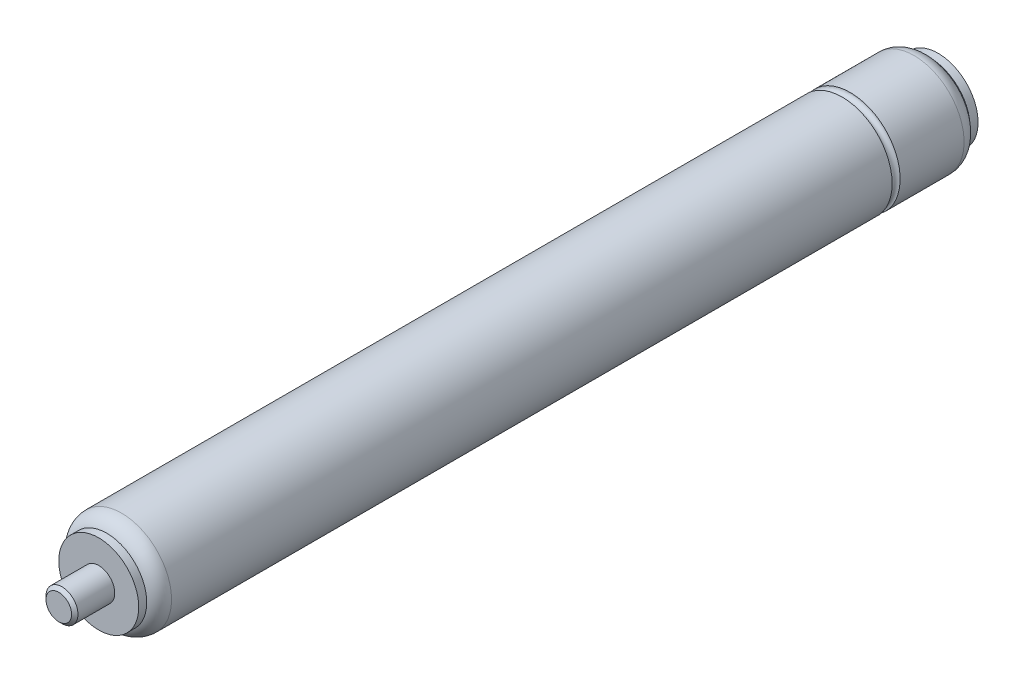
ISO-10303-21;
HEADER;
FILE_DESCRIPTION(('STEP AP214'),'2;1');
FILE_NAME('part.step','',(''),(''),'','','');
FILE_SCHEMA(('AUTOMOTIVE_DESIGN { 1 0 10303 214 1 1 1 1 }'));
ENDSEC;
DATA;
#1=APPLICATION_CONTEXT('core data for automotive mechanical design processes');
#2=APPLICATION_PROTOCOL_DEFINITION('international standard','automotive_design',2000,#1);
#3=PRODUCT_CONTEXT('',#1,'mechanical');
#4=PRODUCT('Part','Part','',(#3));
#5=PRODUCT_RELATED_PRODUCT_CATEGORY('part','',(#4));
#6=PRODUCT_DEFINITION_FORMATION('','',#4);
#7=PRODUCT_DEFINITION_CONTEXT('part definition',#1,'design');
#8=PRODUCT_DEFINITION('design','',#6,#7);
#9=PRODUCT_DEFINITION_SHAPE('','',#8);
#10=(LENGTH_UNIT() NAMED_UNIT(*) SI_UNIT(.MILLI.,.METRE.));
#11=(NAMED_UNIT(*) PLANE_ANGLE_UNIT() SI_UNIT($,.RADIAN.));
#12=(NAMED_UNIT(*) SI_UNIT($,.STERADIAN.) SOLID_ANGLE_UNIT());
#13=UNCERTAINTY_MEASURE_WITH_UNIT(LENGTH_MEASURE(1.E-05),#10,'distance_accuracy_value','');
#14=(GEOMETRIC_REPRESENTATION_CONTEXT(3) GLOBAL_UNCERTAINTY_ASSIGNED_CONTEXT((#13)) GLOBAL_UNIT_ASSIGNED_CONTEXT((#10,
#11,#12)) REPRESENTATION_CONTEXT('',''));
#15=CARTESIAN_POINT('',(0.,0.,0.));
#16=DIRECTION('',(0.,0.,1.));
#17=DIRECTION('',(1.,0.,0.));
#18=AXIS2_PLACEMENT_3D('',#15,#16,#17);
#19=CARTESIAN_POINT('',(0.,0.,-208.));
#20=DIRECTION('',(0.,0.,1.));
#21=DIRECTION('',(1.,0.,0.));
#22=AXIS2_PLACEMENT_3D('',#19,#20,#21);
#23=CYLINDRICAL_SURFACE('',#22,12.5);
#24=CARTESIAN_POINT('',(0.,0.,-188.));
#25=DIRECTION('',(0.,0.,-1.));
#26=DIRECTION('',(-1.,0.,0.));
#27=AXIS2_PLACEMENT_3D('',#24,#25,#26);
#28=CIRCLE('',#27,12.5);
#29=CARTESIAN_POINT('',(-12.5,0.,-188.));
#30=VERTEX_POINT('',#29);
#31=EDGE_CURVE('E82',#30,#30,#28,.T.);
#32=ORIENTED_EDGE('',*,*,#31,.T.);
#33=EDGE_LOOP('',(#32));
#34=FACE_BOUND('',#33,.T.);
#35=CARTESIAN_POINT('',(0.,0.,-204.));
#36=DIRECTION('',(0.,0.,-1.));
#37=DIRECTION('',(-1.,0.,0.));
#38=AXIS2_PLACEMENT_3D('',#35,#36,#37);
#39=CIRCLE('',#38,12.5);
#40=CARTESIAN_POINT('',(-12.5,0.,-204.));
#41=VERTEX_POINT('',#40);
#42=EDGE_CURVE('E10',#41,#41,#39,.F.);
#43=ORIENTED_EDGE('',*,*,#42,.T.);
#44=EDGE_LOOP('',(#43));
#45=FACE_BOUND('',#44,.T.);
#46=ADVANCED_FACE('F35',(#34,#45),#23,.T.);
#47=CARTESIAN_POINT('',(0.,0.,-204.));
#48=DIRECTION('',(0.,0.,-1.));
#49=DIRECTION('',(-1.,0.,0.));
#50=AXIS2_PLACEMENT_3D('',#47,#48,#49);
#51=TOROIDAL_SURFACE('',#50,8.5,4.);
#52=ORIENTED_EDGE('',*,*,#42,.F.);
#53=EDGE_LOOP('',(#52));
#54=FACE_BOUND('',#53,.T.);
#55=CARTESIAN_POINT('',(0.,0.,-208.));
#56=DIRECTION('',(0.,0.,-1.));
#57=DIRECTION('',(-1.,0.,0.));
#58=AXIS2_PLACEMENT_3D('',#55,#56,#57);
#59=CIRCLE('',#58,8.5);
#60=CARTESIAN_POINT('',(-8.5,0.,-208.));
#61=VERTEX_POINT('',#60);
#62=EDGE_CURVE('E46',#61,#61,#59,.T.);
#63=ORIENTED_EDGE('',*,*,#62,.F.);
#64=EDGE_LOOP('',(#63));
#65=FACE_BOUND('',#64,.T.);
#66=ADVANCED_FACE('F106',(#54,#65),#51,.T.);
#67=CARTESIAN_POINT('',(0.,0.,-210.));
#68=DIRECTION('',(0.,0.,1.));
#69=DIRECTION('',(1.,0.,0.));
#70=AXIS2_PLACEMENT_3D('',#67,#68,#69);
#71=CYLINDRICAL_SURFACE('',#70,10.);
#72=CARTESIAN_POINT('',(0.,0.,-210.));
#73=DIRECTION('',(0.,0.,-1.));
#74=DIRECTION('',(-1.,0.,0.));
#75=AXIS2_PLACEMENT_3D('',#72,#73,#74);
#76=CIRCLE('',#75,10.);
#77=CARTESIAN_POINT('',(-10.,0.,-210.));
#78=VERTEX_POINT('',#77);
#79=EDGE_CURVE('E67',#78,#78,#76,.T.);
#80=ORIENTED_EDGE('',*,*,#79,.F.);
#81=EDGE_LOOP('',(#80));
#82=FACE_BOUND('',#81,.T.);
#83=CARTESIAN_POINT('',(0.,0.,-208.));
#84=DIRECTION('',(0.,0.,-1.));
#85=DIRECTION('',(-1.,0.,0.));
#86=AXIS2_PLACEMENT_3D('',#83,#84,#85);
#87=CIRCLE('',#86,10.);
#88=CARTESIAN_POINT('',(-10.,0.,-208.));
#89=VERTEX_POINT('',#88);
#90=EDGE_CURVE('E68',#89,#89,#87,.T.);
#91=ORIENTED_EDGE('',*,*,#90,.T.);
#92=EDGE_LOOP('',(#91));
#93=FACE_BOUND('',#92,.T.);
#94=ADVANCED_FACE('F110',(#82,#93),#71,.T.);
#95=CARTESIAN_POINT('',(0.,0.,-210.));
#96=DIRECTION('',(0.,0.,-1.));
#97=DIRECTION('',(-1.,0.,0.));
#98=AXIS2_PLACEMENT_3D('',#95,#96,#97);
#99=PLANE('',#98);
#100=CARTESIAN_POINT('',(0.,0.,-210.));
#101=DIRECTION('',(0.,0.,-1.));
#102=DIRECTION('',(-1.,0.,0.));
#103=AXIS2_PLACEMENT_3D('',#100,#101,#102);
#104=CIRCLE('',#103,5.);
#105=CARTESIAN_POINT('',(-5.,0.,-210.));
#106=VERTEX_POINT('',#105);
#107=EDGE_CURVE('E74',#106,#106,#104,.T.);
#108=ORIENTED_EDGE('',*,*,#107,.F.);
#109=EDGE_LOOP('',(#108));
#110=FACE_BOUND('',#109,.T.);
#111=ORIENTED_EDGE('',*,*,#79,.T.);
#112=EDGE_LOOP('',(#111));
#113=FACE_BOUND('',#112,.T.);
#114=ADVANCED_FACE('F115',(#110,#113),#99,.T.);
#115=CARTESIAN_POINT('',(0.,0.,-208.));
#116=DIRECTION('',(0.,0.,-1.));
#117=DIRECTION('',(-1.,0.,0.));
#118=AXIS2_PLACEMENT_3D('',#115,#116,#117);
#119=PLANE('',#118);
#120=ORIENTED_EDGE('',*,*,#62,.T.);
#121=EDGE_LOOP('',(#120));
#122=FACE_BOUND('',#121,.T.);
#123=ORIENTED_EDGE('',*,*,#90,.F.);
#124=EDGE_LOOP('',(#123));
#125=FACE_BOUND('',#124,.T.);
#126=ADVANCED_FACE('F175',(#122,#125),#119,.F.);
#127=CARTESIAN_POINT('',(0.,0.,-9.99999999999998));
#128=DIRECTION('',(0.,0.,-1.));
#129=DIRECTION('',(-1.,0.,0.));
#130=AXIS2_PLACEMENT_3D('',#127,#128,#129);
#131=CYLINDRICAL_SURFACE('',#130,5.);
#132=CARTESIAN_POINT('',(0.,0.,-9.99999999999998));
#133=DIRECTION('',(0.,0.,-1.));
#134=DIRECTION('',(-1.,0.,0.));
#135=AXIS2_PLACEMENT_3D('',#132,#133,#134);
#136=CIRCLE('',#135,5.);
#137=CARTESIAN_POINT('',(-5.,0.,-9.99999999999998));
#138=VERTEX_POINT('',#137);
#139=EDGE_CURVE('E71',#138,#138,#136,.T.);
#140=ORIENTED_EDGE('',*,*,#139,.F.);
#141=EDGE_LOOP('',(#140));
#142=FACE_BOUND('',#141,.T.);
#143=ORIENTED_EDGE('',*,*,#107,.T.);
#144=EDGE_LOOP('',(#143));
#145=FACE_BOUND('',#144,.T.);
#146=ADVANCED_FACE('F180',(#142,#145),#131,.F.);
#147=CARTESIAN_POINT('',(0.,0.,-9.99999999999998));
#148=DIRECTION('',(0.,0.,-1.));
#149=DIRECTION('',(-1.,0.,0.));
#150=AXIS2_PLACEMENT_3D('',#147,#148,#149);
#151=PLANE('',#150);
#152=ORIENTED_EDGE('',*,*,#139,.T.);
#153=EDGE_LOOP('',(#152));
#154=FACE_BOUND('',#153,.T.);
#155=ADVANCED_FACE('F91',(#154),#151,.T.);
#156=CARTESIAN_POINT('',(0.,0.,-187.));
#157=DIRECTION('',(0.,0.,-1.));
#158=DIRECTION('',(-1.,0.,0.));
#159=AXIS2_PLACEMENT_3D('',#156,#157,#158);
#160=TOROIDAL_SURFACE('',#159,12.5,1.);
#161=ORIENTED_EDGE('',*,*,#31,.F.);
#162=EDGE_LOOP('',(#161));
#163=FACE_BOUND('',#162,.T.);
#164=CARTESIAN_POINT('',(0.,0.,-186.));
#165=DIRECTION('',(0.,0.,-1.));
#166=DIRECTION('',(-1.,0.,0.));
#167=AXIS2_PLACEMENT_3D('',#164,#165,#166);
#168=CIRCLE('',#167,12.5);
#169=CARTESIAN_POINT('',(-12.5,0.,-186.));
#170=VERTEX_POINT('',#169);
#171=EDGE_CURVE('E77',#170,#170,#168,.T.);
#172=ORIENTED_EDGE('',*,*,#171,.T.);
#173=EDGE_LOOP('',(#172));
#174=FACE_BOUND('',#173,.T.);
#175=ADVANCED_FACE('F87',(#163,#174),#160,.F.);
#176=CARTESIAN_POINT('',(0.,0.,10.));
#177=DIRECTION('',(0.,0.,1.));
#178=DIRECTION('',(1.,0.,0.));
#179=AXIS2_PLACEMENT_3D('',#176,#177,#178);
#180=PLANE('',#179);
#181=CARTESIAN_POINT('',(0.,0.,10.));
#182=DIRECTION('',(0.,0.,1.));
#183=DIRECTION('',(1.,0.,0.));
#184=AXIS2_PLACEMENT_3D('',#181,#182,#183);
#185=CIRCLE('',#184,3.2);
#186=CARTESIAN_POINT('',(3.2,0.,10.));
#187=VERTEX_POINT('',#186);
#188=EDGE_CURVE('E55',#187,#187,#185,.T.);
#189=ORIENTED_EDGE('',*,*,#188,.T.);
#190=EDGE_LOOP('',(#189));
#191=FACE_BOUND('',#190,.T.);
#192=ADVANCED_FACE('F90',(#191),#180,.T.);
#193=CARTESIAN_POINT('',(0.,0.,10.));
#194=DIRECTION('',(0.,0.,-1.));
#195=DIRECTION('',(-1.,0.,0.));
#196=AXIS2_PLACEMENT_3D('',#193,#194,#195);
#197=CONICAL_SURFACE('',#196,3.2,0.785398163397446);
#198=CARTESIAN_POINT('',(0.,0.,9.2));
#199=DIRECTION('',(0.,0.,1.));
#200=DIRECTION('',(1.,0.,0.));
#201=AXIS2_PLACEMENT_3D('',#198,#199,#200);
#202=CIRCLE('',#201,4.);
#203=CARTESIAN_POINT('',(4.,0.,9.2));
#204=VERTEX_POINT('',#203);
#205=EDGE_CURVE('E50',#204,#204,#202,.F.);
#206=ORIENTED_EDGE('',*,*,#205,.F.);
#207=EDGE_LOOP('',(#206));
#208=FACE_BOUND('',#207,.T.);
#209=ORIENTED_EDGE('',*,*,#188,.F.);
#210=EDGE_LOOP('',(#209));
#211=FACE_BOUND('',#210,.T.);
#212=ADVANCED_FACE('F119',(#208,#211),#197,.T.);
#213=CARTESIAN_POINT('',(0.,0.,0.));
#214=DIRECTION('',(0.,0.,1.));
#215=DIRECTION('',(1.,0.,0.));
#216=AXIS2_PLACEMENT_3D('',#213,#214,#215);
#217=CYLINDRICAL_SURFACE('',#216,4.);
#218=ORIENTED_EDGE('',*,*,#205,.T.);
#219=EDGE_LOOP('',(#218));
#220=FACE_BOUND('',#219,.T.);
#221=CARTESIAN_POINT('',(0.,0.,0.));
#222=DIRECTION('',(0.,0.,1.));
#223=DIRECTION('',(1.,0.,0.));
#224=AXIS2_PLACEMENT_3D('',#221,#222,#223);
#225=CIRCLE('',#224,4.);
#226=CARTESIAN_POINT('',(4.,0.,0.));
#227=VERTEX_POINT('',#226);
#228=EDGE_CURVE('E64',#227,#227,#225,.T.);
#229=ORIENTED_EDGE('',*,*,#228,.T.);
#230=EDGE_LOOP('',(#229));
#231=FACE_BOUND('',#230,.T.);
#232=ADVANCED_FACE('F122',(#220,#231),#217,.T.);
#233=CARTESIAN_POINT('',(0.,0.,0.));
#234=DIRECTION('',(0.,0.,-1.));
#235=DIRECTION('',(-1.,0.,0.));
#236=AXIS2_PLACEMENT_3D('',#233,#234,#235);
#237=PLANE('',#236);
#238=ORIENTED_EDGE('',*,*,#228,.F.);
#239=EDGE_LOOP('',(#238));
#240=FACE_BOUND('',#239,.T.);
#241=CARTESIAN_POINT('',(0.,0.,0.));
#242=DIRECTION('',(0.,0.,-1.));
#243=DIRECTION('',(-1.,0.,0.));
#244=AXIS2_PLACEMENT_3D('',#241,#242,#243);
#245=CIRCLE('',#244,10.);
#246=CARTESIAN_POINT('',(-10.,0.,0.));
#247=VERTEX_POINT('',#246);
#248=EDGE_CURVE('E61',#247,#247,#245,.T.);
#249=ORIENTED_EDGE('',*,*,#248,.F.);
#250=EDGE_LOOP('',(#249));
#251=FACE_BOUND('',#250,.T.);
#252=ADVANCED_FACE('F126',(#240,#251),#237,.F.);
#253=CARTESIAN_POINT('',(0.,0.,0.));
#254=DIRECTION('',(0.,0.,-1.));
#255=DIRECTION('',(-1.,0.,0.));
#256=AXIS2_PLACEMENT_3D('',#253,#254,#255);
#257=CYLINDRICAL_SURFACE('',#256,10.);
#258=CARTESIAN_POINT('',(0.,0.,-2.));
#259=DIRECTION('',(0.,0.,-1.));
#260=DIRECTION('',(-1.,0.,0.));
#261=AXIS2_PLACEMENT_3D('',#258,#259,#260);
#262=CIRCLE('',#261,10.);
#263=CARTESIAN_POINT('',(-10.,0.,-2.));
#264=VERTEX_POINT('',#263);
#265=EDGE_CURVE('E58',#264,#264,#262,.T.);
#266=ORIENTED_EDGE('',*,*,#265,.F.);
#267=EDGE_LOOP('',(#266));
#268=FACE_BOUND('',#267,.T.);
#269=ORIENTED_EDGE('',*,*,#248,.T.);
#270=EDGE_LOOP('',(#269));
#271=FACE_BOUND('',#270,.T.);
#272=ADVANCED_FACE('F101',(#268,#271),#257,.T.);
#273=CARTESIAN_POINT('',(0.,0.,-5.70809924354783));
#274=DIRECTION('',(0.,0.,1.));
#275=DIRECTION('',(1.,0.,0.));
#276=AXIS2_PLACEMENT_3D('',#273,#274,#275);
#277=TOROIDAL_SURFACE('',#276,8.5,4.);
#278=ORIENTED_EDGE('',*,*,#265,.T.);
#279=EDGE_LOOP('',(#278));
#280=FACE_BOUND('',#279,.T.);
#281=CARTESIAN_POINT('',(0.,0.,-5.70809924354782));
#282=DIRECTION('',(0.,0.,1.));
#283=DIRECTION('',(1.,0.,0.));
#284=AXIS2_PLACEMENT_3D('',#281,#282,#283);
#285=CIRCLE('',#284,12.5);
#286=CARTESIAN_POINT('',(12.5,0.,-5.70809924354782));
#287=VERTEX_POINT('',#286);
#288=EDGE_CURVE('E42',#287,#287,#285,.F.);
#289=ORIENTED_EDGE('',*,*,#288,.F.);
#290=EDGE_LOOP('',(#289));
#291=FACE_BOUND('',#290,.T.);
#292=ADVANCED_FACE('F37',(#280,#291),#277,.T.);
#293=ORIENTED_EDGE('',*,*,#171,.F.);
#294=EDGE_LOOP('',(#293));
#295=FACE_BOUND('',#294,.T.);
#296=ORIENTED_EDGE('',*,*,#288,.T.);
#297=EDGE_LOOP('',(#296));
#298=FACE_BOUND('',#297,.T.);
#299=ADVANCED_FACE('F95',(#295,#298),#23,.T.);
#300=CLOSED_SHELL('',(#46,#66,#94,#114,#126,#146,#155,#175,#192,#212,#232,#252,#272,#292,#299));
#301=MANIFOLD_SOLID_BREP('B2',#300);
#302=ADVANCED_BREP_SHAPE_REPRESENTATION('',(#18,#301),#14);
#303=SHAPE_DEFINITION_REPRESENTATION(#9,#302);
ENDSEC;
END-ISO-10303-21;
